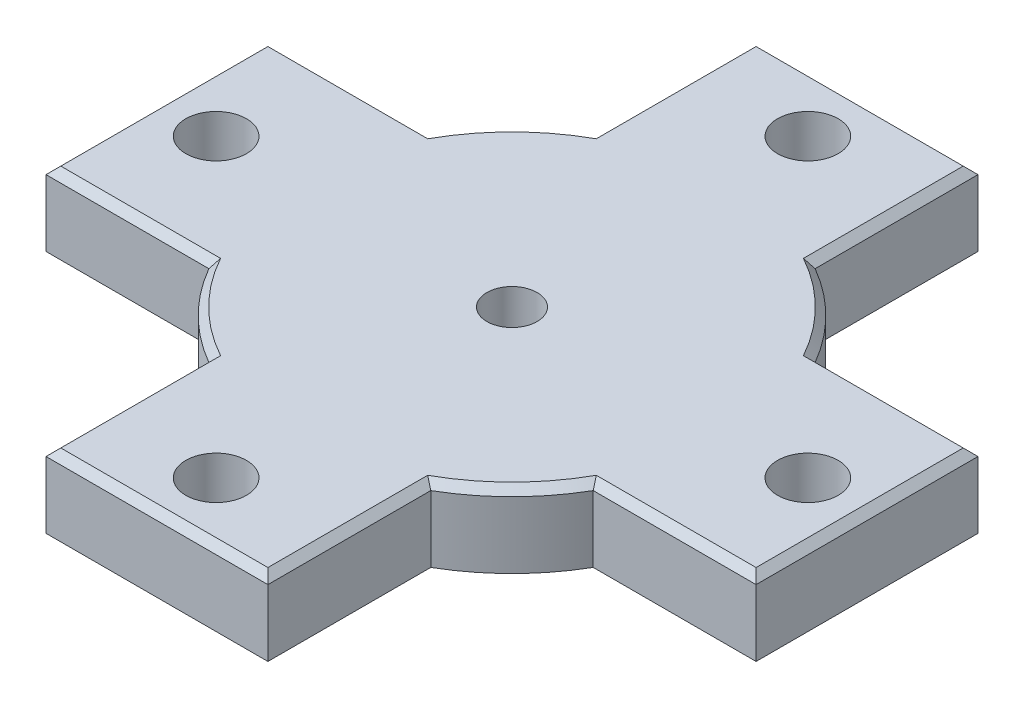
ISO-10303-21;
HEADER;
FILE_DESCRIPTION(('STEP AP214'),'2;1');
FILE_NAME('part.step','',(''),(''),'','','');
FILE_SCHEMA(('AUTOMOTIVE_DESIGN { 1 0 10303 214 1 1 1 1 }'));
ENDSEC;
DATA;
#1=APPLICATION_CONTEXT('core data for automotive mechanical design processes');
#2=APPLICATION_PROTOCOL_DEFINITION('international standard','automotive_design',2000,#1);
#3=PRODUCT_CONTEXT('',#1,'mechanical');
#4=PRODUCT('Part','Part','',(#3));
#5=PRODUCT_RELATED_PRODUCT_CATEGORY('part','',(#4));
#6=PRODUCT_DEFINITION_FORMATION('','',#4);
#7=PRODUCT_DEFINITION_CONTEXT('part definition',#1,'design');
#8=PRODUCT_DEFINITION('design','',#6,#7);
#9=PRODUCT_DEFINITION_SHAPE('','',#8);
#10=(LENGTH_UNIT() NAMED_UNIT(*) SI_UNIT(.MILLI.,.METRE.));
#11=(NAMED_UNIT(*) PLANE_ANGLE_UNIT() SI_UNIT($,.RADIAN.));
#12=(NAMED_UNIT(*) SI_UNIT($,.STERADIAN.) SOLID_ANGLE_UNIT());
#13=UNCERTAINTY_MEASURE_WITH_UNIT(LENGTH_MEASURE(1.E-05),#10,'distance_accuracy_value','');
#14=(GEOMETRIC_REPRESENTATION_CONTEXT(3) GLOBAL_UNCERTAINTY_ASSIGNED_CONTEXT((#13)) GLOBAL_UNIT_ASSIGNED_CONTEXT((#10,
#11,#12)) REPRESENTATION_CONTEXT('',''));
#15=CARTESIAN_POINT('',(0.,0.,0.));
#16=DIRECTION('',(0.,0.,1.));
#17=DIRECTION('',(1.,0.,0.));
#18=AXIS2_PLACEMENT_3D('',#15,#16,#17);
#19=CARTESIAN_POINT('',(0.,10.,0.));
#20=DIRECTION('',(0.,-1.,0.));
#21=DIRECTION('',(0.,0.,-1.));
#22=AXIS2_PLACEMENT_3D('',#19,#20,#21);
#23=CYLINDRICAL_SURFACE('',#22,30.);
#24=DIRECTION('',(0.,-1.,0.));
#25=VECTOR('',#24,1.);
#26=CARTESIAN_POINT('',(-25.9807621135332,10.,-15.));
#27=LINE('',#26,#25);
#28=CARTESIAN_POINT('',(-25.9807621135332,9.00000000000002,-15.));
#29=VERTEX_POINT('',#28);
#30=CARTESIAN_POINT('',(-25.9807621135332,0.,-15.));
#31=VERTEX_POINT('',#30);
#32=EDGE_CURVE('E207',#29,#31,#27,.T.);
#33=ORIENTED_EDGE('',*,*,#32,.F.);
#34=CARTESIAN_POINT('',(0.,9.00000000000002,0.));
#35=DIRECTION('',(0.,1.,0.));
#36=DIRECTION('',(0.,0.,1.));
#37=AXIS2_PLACEMENT_3D('',#34,#35,#36);
#38=CIRCLE('',#37,30.);
#39=CARTESIAN_POINT('',(-15.,9.00000000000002,-25.9807621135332));
#40=VERTEX_POINT('',#39);
#41=EDGE_CURVE('E12',#29,#40,#38,.F.);
#42=ORIENTED_EDGE('',*,*,#41,.T.);
#43=DIRECTION('',(0.,-1.,0.));
#44=VECTOR('',#43,1.);
#45=CARTESIAN_POINT('',(-15.,10.,-25.9807621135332));
#46=LINE('',#45,#44);
#47=CARTESIAN_POINT('',(-15.,0.,-25.9807621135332));
#48=VERTEX_POINT('',#47);
#49=EDGE_CURVE('E228',#40,#48,#46,.T.);
#50=ORIENTED_EDGE('',*,*,#49,.T.);
#51=CARTESIAN_POINT('',(0.,0.,0.));
#52=DIRECTION('',(0.,1.,0.));
#53=DIRECTION('',(0.,0.,1.));
#54=AXIS2_PLACEMENT_3D('',#51,#52,#53);
#55=CIRCLE('',#54,30.);
#56=EDGE_CURVE('E222',#48,#31,#55,.T.);
#57=ORIENTED_EDGE('',*,*,#56,.T.);
#58=EDGE_LOOP('',(#33,#42,#50,#57));
#59=FACE_BOUND('',#58,.T.);
#60=ADVANCED_FACE('F41',(#59),#23,.T.);
#61=CARTESIAN_POINT('',(-48.,10.,-15.));
#62=DIRECTION('',(0.,0.,1.));
#63=DIRECTION('',(1.,0.,0.));
#64=AXIS2_PLACEMENT_3D('',#61,#62,#63);
#65=PLANE('',#64);
#66=DIRECTION('',(0.,-1.,0.));
#67=VECTOR('',#66,1.);
#68=CARTESIAN_POINT('',(-48.,10.,-15.));
#69=LINE('',#68,#67);
#70=CARTESIAN_POINT('',(-48.,9.00000000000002,-15.));
#71=VERTEX_POINT('',#70);
#72=CARTESIAN_POINT('',(-48.,0.,-15.));
#73=VERTEX_POINT('',#72);
#74=EDGE_CURVE('E216',#71,#73,#69,.T.);
#75=ORIENTED_EDGE('',*,*,#74,.F.);
#76=DIRECTION('',(1.,0.,0.));
#77=VECTOR('',#76,1.);
#78=CARTESIAN_POINT('',(-25.9807621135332,9.00000000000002,-15.));
#79=LINE('',#78,#77);
#80=EDGE_CURVE('E56',#71,#29,#79,.T.);
#81=ORIENTED_EDGE('',*,*,#80,.T.);
#82=ORIENTED_EDGE('',*,*,#32,.T.);
#83=DIRECTION('',(-1.,0.,0.));
#84=VECTOR('',#83,1.);
#85=CARTESIAN_POINT('',(-48.,0.,-15.));
#86=LINE('',#85,#84);
#87=EDGE_CURVE('E210',#31,#73,#86,.T.);
#88=ORIENTED_EDGE('',*,*,#87,.T.);
#89=EDGE_LOOP('',(#75,#81,#82,#88));
#90=FACE_BOUND('',#89,.T.);
#91=ADVANCED_FACE('F209',(#90),#65,.F.);
#92=CARTESIAN_POINT('',(-48.,10.,15.));
#93=DIRECTION('',(1.,0.,0.));
#94=DIRECTION('',(0.,0.,-1.));
#95=AXIS2_PLACEMENT_3D('',#92,#93,#94);
#96=PLANE('',#95);
#97=DIRECTION('',(0.,-1.,0.));
#98=VECTOR('',#97,1.);
#99=CARTESIAN_POINT('',(-48.,10.,15.));
#100=LINE('',#99,#98);
#101=CARTESIAN_POINT('',(-48.,9.00000000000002,15.));
#102=VERTEX_POINT('',#101);
#103=CARTESIAN_POINT('',(-48.,0.,15.));
#104=VERTEX_POINT('',#103);
#105=EDGE_CURVE('E301',#102,#104,#100,.T.);
#106=ORIENTED_EDGE('',*,*,#105,.F.);
#107=DIRECTION('',(0.,0.,-1.));
#108=VECTOR('',#107,1.);
#109=CARTESIAN_POINT('',(-48.,9.00000000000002,-15.));
#110=LINE('',#109,#108);
#111=EDGE_CURVE('E71',#102,#71,#110,.T.);
#112=ORIENTED_EDGE('',*,*,#111,.T.);
#113=ORIENTED_EDGE('',*,*,#74,.T.);
#114=DIRECTION('',(0.,0.,1.));
#115=VECTOR('',#114,1.);
#116=CARTESIAN_POINT('',(-48.,0.,15.));
#117=LINE('',#116,#115);
#118=EDGE_CURVE('E225',#73,#104,#117,.T.);
#119=ORIENTED_EDGE('',*,*,#118,.T.);
#120=EDGE_LOOP('',(#106,#112,#113,#119));
#121=FACE_BOUND('',#120,.T.);
#122=ADVANCED_FACE('F549',(#121),#96,.F.);
#123=CARTESIAN_POINT('',(-25.9807621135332,10.,15.));
#124=DIRECTION('',(0.,0.,-1.));
#125=DIRECTION('',(-1.,0.,0.));
#126=AXIS2_PLACEMENT_3D('',#123,#124,#125);
#127=PLANE('',#126);
#128=DIRECTION('',(0.,-1.,0.));
#129=VECTOR('',#128,1.);
#130=CARTESIAN_POINT('',(-25.9807621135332,10.,15.));
#131=LINE('',#130,#129);
#132=CARTESIAN_POINT('',(-25.9807621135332,9.00000000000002,15.));
#133=VERTEX_POINT('',#132);
#134=CARTESIAN_POINT('',(-25.9807621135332,0.,15.));
#135=VERTEX_POINT('',#134);
#136=EDGE_CURVE('E299',#133,#135,#131,.T.);
#137=ORIENTED_EDGE('',*,*,#136,.F.);
#138=DIRECTION('',(-1.,0.,0.));
#139=VECTOR('',#138,1.);
#140=CARTESIAN_POINT('',(-48.,9.00000000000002,15.));
#141=LINE('',#140,#139);
#142=EDGE_CURVE('E361',#133,#102,#141,.T.);
#143=ORIENTED_EDGE('',*,*,#142,.T.);
#144=ORIENTED_EDGE('',*,*,#105,.T.);
#145=DIRECTION('',(1.,0.,0.));
#146=VECTOR('',#145,1.);
#147=CARTESIAN_POINT('',(-25.9807621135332,0.,15.));
#148=LINE('',#147,#146);
#149=EDGE_CURVE('E238',#104,#135,#148,.T.);
#150=ORIENTED_EDGE('',*,*,#149,.T.);
#151=EDGE_LOOP('',(#137,#143,#144,#150));
#152=FACE_BOUND('',#151,.T.);
#153=ADVANCED_FACE('F512',(#152),#127,.F.);
#154=CARTESIAN_POINT('',(0.,10.,0.));
#155=DIRECTION('',(0.,-1.,0.));
#156=DIRECTION('',(0.,0.,-1.));
#157=AXIS2_PLACEMENT_3D('',#154,#155,#156);
#158=CYLINDRICAL_SURFACE('',#157,30.);
#159=DIRECTION('',(0.,-1.,0.));
#160=VECTOR('',#159,1.);
#161=CARTESIAN_POINT('',(-15.,10.,25.9807621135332));
#162=LINE('',#161,#160);
#163=CARTESIAN_POINT('',(-15.,9.00000000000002,25.9807621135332));
#164=VERTEX_POINT('',#163);
#165=CARTESIAN_POINT('',(-15.,0.,25.9807621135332));
#166=VERTEX_POINT('',#165);
#167=EDGE_CURVE('E297',#164,#166,#162,.T.);
#168=ORIENTED_EDGE('',*,*,#167,.F.);
#169=CARTESIAN_POINT('',(0.,9.00000000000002,0.));
#170=DIRECTION('',(0.,1.,0.));
#171=DIRECTION('',(0.,0.,1.));
#172=AXIS2_PLACEMENT_3D('',#169,#170,#171);
#173=CIRCLE('',#172,30.);
#174=EDGE_CURVE('E359',#164,#133,#173,.F.);
#175=ORIENTED_EDGE('',*,*,#174,.T.);
#176=ORIENTED_EDGE('',*,*,#136,.T.);
#177=CARTESIAN_POINT('',(0.,0.,0.));
#178=DIRECTION('',(0.,1.,0.));
#179=DIRECTION('',(0.,0.,1.));
#180=AXIS2_PLACEMENT_3D('',#177,#178,#179);
#181=CIRCLE('',#180,30.);
#182=EDGE_CURVE('E241',#135,#166,#181,.T.);
#183=ORIENTED_EDGE('',*,*,#182,.T.);
#184=EDGE_LOOP('',(#168,#175,#176,#183));
#185=FACE_BOUND('',#184,.T.);
#186=ADVANCED_FACE('F510',(#185),#158,.T.);
#187=CARTESIAN_POINT('',(-15.,10.,48.));
#188=DIRECTION('',(1.,0.,0.));
#189=DIRECTION('',(0.,0.,-1.));
#190=AXIS2_PLACEMENT_3D('',#187,#188,#189);
#191=PLANE('',#190);
#192=DIRECTION('',(0.,-1.,0.));
#193=VECTOR('',#192,1.);
#194=CARTESIAN_POINT('',(-15.,10.,48.));
#195=LINE('',#194,#193);
#196=CARTESIAN_POINT('',(-15.,9.00000000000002,48.));
#197=VERTEX_POINT('',#196);
#198=CARTESIAN_POINT('',(-15.,0.,48.));
#199=VERTEX_POINT('',#198);
#200=EDGE_CURVE('E295',#197,#199,#195,.T.);
#201=ORIENTED_EDGE('',*,*,#200,.F.);
#202=DIRECTION('',(0.,0.,-1.));
#203=VECTOR('',#202,1.);
#204=CARTESIAN_POINT('',(-15.,9.00000000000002,25.9807621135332));
#205=LINE('',#204,#203);
#206=EDGE_CURVE('E357',#197,#164,#205,.T.);
#207=ORIENTED_EDGE('',*,*,#206,.T.);
#208=ORIENTED_EDGE('',*,*,#167,.T.);
#209=DIRECTION('',(0.,0.,1.));
#210=VECTOR('',#209,1.);
#211=CARTESIAN_POINT('',(-15.,0.,48.));
#212=LINE('',#211,#210);
#213=EDGE_CURVE('E244',#166,#199,#212,.T.);
#214=ORIENTED_EDGE('',*,*,#213,.T.);
#215=EDGE_LOOP('',(#201,#207,#208,#214));
#216=FACE_BOUND('',#215,.T.);
#217=ADVANCED_FACE('F519',(#216),#191,.F.);
#218=CARTESIAN_POINT('',(15.,10.,48.));
#219=DIRECTION('',(0.,0.,-1.));
#220=DIRECTION('',(-1.,0.,0.));
#221=AXIS2_PLACEMENT_3D('',#218,#219,#220);
#222=PLANE('',#221);
#223=DIRECTION('',(0.,-1.,0.));
#224=VECTOR('',#223,1.);
#225=CARTESIAN_POINT('',(15.,10.,48.));
#226=LINE('',#225,#224);
#227=CARTESIAN_POINT('',(15.,9.00000000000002,48.));
#228=VERTEX_POINT('',#227);
#229=CARTESIAN_POINT('',(15.,0.,48.));
#230=VERTEX_POINT('',#229);
#231=EDGE_CURVE('E293',#228,#230,#226,.T.);
#232=ORIENTED_EDGE('',*,*,#231,.F.);
#233=DIRECTION('',(-1.,0.,0.));
#234=VECTOR('',#233,1.);
#235=CARTESIAN_POINT('',(-15.,9.00000000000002,48.));
#236=LINE('',#235,#234);
#237=EDGE_CURVE('E355',#228,#197,#236,.T.);
#238=ORIENTED_EDGE('',*,*,#237,.T.);
#239=ORIENTED_EDGE('',*,*,#200,.T.);
#240=DIRECTION('',(1.,0.,0.));
#241=VECTOR('',#240,1.);
#242=CARTESIAN_POINT('',(15.,0.,48.));
#243=LINE('',#242,#241);
#244=EDGE_CURVE('E247',#199,#230,#243,.T.);
#245=ORIENTED_EDGE('',*,*,#244,.T.);
#246=EDGE_LOOP('',(#232,#238,#239,#245));
#247=FACE_BOUND('',#246,.T.);
#248=ADVANCED_FACE('F560',(#247),#222,.F.);
#249=CARTESIAN_POINT('',(15.,10.,25.9807621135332));
#250=DIRECTION('',(-1.,0.,0.));
#251=DIRECTION('',(0.,0.,1.));
#252=AXIS2_PLACEMENT_3D('',#249,#250,#251);
#253=PLANE('',#252);
#254=DIRECTION('',(0.,-1.,0.));
#255=VECTOR('',#254,1.);
#256=CARTESIAN_POINT('',(15.,10.,25.9807621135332));
#257=LINE('',#256,#255);
#258=CARTESIAN_POINT('',(15.,9.00000000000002,25.9807621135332));
#259=VERTEX_POINT('',#258);
#260=CARTESIAN_POINT('',(15.,0.,25.9807621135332));
#261=VERTEX_POINT('',#260);
#262=EDGE_CURVE('E291',#259,#261,#257,.T.);
#263=ORIENTED_EDGE('',*,*,#262,.F.);
#264=DIRECTION('',(0.,0.,1.));
#265=VECTOR('',#264,1.);
#266=CARTESIAN_POINT('',(15.,9.00000000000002,48.));
#267=LINE('',#266,#265);
#268=EDGE_CURVE('E353',#259,#228,#267,.T.);
#269=ORIENTED_EDGE('',*,*,#268,.T.);
#270=ORIENTED_EDGE('',*,*,#231,.T.);
#271=DIRECTION('',(0.,0.,-1.));
#272=VECTOR('',#271,1.);
#273=CARTESIAN_POINT('',(15.,0.,25.9807621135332));
#274=LINE('',#273,#272);
#275=EDGE_CURVE('E250',#230,#261,#274,.T.);
#276=ORIENTED_EDGE('',*,*,#275,.T.);
#277=EDGE_LOOP('',(#263,#269,#270,#276));
#278=FACE_BOUND('',#277,.T.);
#279=ADVANCED_FACE('F563',(#278),#253,.F.);
#280=CARTESIAN_POINT('',(0.,10.,0.));
#281=DIRECTION('',(0.,-1.,0.));
#282=DIRECTION('',(0.,0.,-1.));
#283=AXIS2_PLACEMENT_3D('',#280,#281,#282);
#284=CYLINDRICAL_SURFACE('',#283,30.);
#285=DIRECTION('',(0.,-1.,0.));
#286=VECTOR('',#285,1.);
#287=CARTESIAN_POINT('',(25.9807621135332,10.,15.));
#288=LINE('',#287,#286);
#289=CARTESIAN_POINT('',(25.9807621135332,9.00000000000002,15.));
#290=VERTEX_POINT('',#289);
#291=CARTESIAN_POINT('',(25.9807621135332,0.,15.));
#292=VERTEX_POINT('',#291);
#293=EDGE_CURVE('E289',#290,#292,#288,.T.);
#294=ORIENTED_EDGE('',*,*,#293,.F.);
#295=CARTESIAN_POINT('',(0.,9.00000000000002,0.));
#296=DIRECTION('',(0.,1.,0.));
#297=DIRECTION('',(0.,0.,1.));
#298=AXIS2_PLACEMENT_3D('',#295,#296,#297);
#299=CIRCLE('',#298,30.);
#300=EDGE_CURVE('E351',#290,#259,#299,.F.);
#301=ORIENTED_EDGE('',*,*,#300,.T.);
#302=ORIENTED_EDGE('',*,*,#262,.T.);
#303=CARTESIAN_POINT('',(0.,0.,0.));
#304=DIRECTION('',(0.,1.,0.));
#305=DIRECTION('',(0.,0.,1.));
#306=AXIS2_PLACEMENT_3D('',#303,#304,#305);
#307=CIRCLE('',#306,30.);
#308=EDGE_CURVE('E253',#261,#292,#307,.T.);
#309=ORIENTED_EDGE('',*,*,#308,.T.);
#310=EDGE_LOOP('',(#294,#301,#302,#309));
#311=FACE_BOUND('',#310,.T.);
#312=ADVANCED_FACE('F535',(#311),#284,.T.);
#313=CARTESIAN_POINT('',(48.,10.,15.));
#314=DIRECTION('',(0.,0.,-1.));
#315=DIRECTION('',(-1.,0.,0.));
#316=AXIS2_PLACEMENT_3D('',#313,#314,#315);
#317=PLANE('',#316);
#318=DIRECTION('',(0.,-1.,0.));
#319=VECTOR('',#318,1.);
#320=CARTESIAN_POINT('',(48.,10.,15.));
#321=LINE('',#320,#319);
#322=CARTESIAN_POINT('',(48.,9.00000000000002,15.));
#323=VERTEX_POINT('',#322);
#324=CARTESIAN_POINT('',(48.,0.,15.));
#325=VERTEX_POINT('',#324);
#326=EDGE_CURVE('E287',#323,#325,#321,.T.);
#327=ORIENTED_EDGE('',*,*,#326,.F.);
#328=DIRECTION('',(-1.,0.,0.));
#329=VECTOR('',#328,1.);
#330=CARTESIAN_POINT('',(25.9807621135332,9.00000000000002,15.));
#331=LINE('',#330,#329);
#332=EDGE_CURVE('E349',#323,#290,#331,.T.);
#333=ORIENTED_EDGE('',*,*,#332,.T.);
#334=ORIENTED_EDGE('',*,*,#293,.T.);
#335=DIRECTION('',(1.,0.,0.));
#336=VECTOR('',#335,1.);
#337=CARTESIAN_POINT('',(48.,0.,15.));
#338=LINE('',#337,#336);
#339=EDGE_CURVE('E256',#292,#325,#338,.T.);
#340=ORIENTED_EDGE('',*,*,#339,.T.);
#341=EDGE_LOOP('',(#327,#333,#334,#340));
#342=FACE_BOUND('',#341,.T.);
#343=ADVANCED_FACE('F532',(#342),#317,.F.);
#344=CARTESIAN_POINT('',(48.,10.,-15.));
#345=DIRECTION('',(-1.,0.,0.));
#346=DIRECTION('',(0.,0.,1.));
#347=AXIS2_PLACEMENT_3D('',#344,#345,#346);
#348=PLANE('',#347);
#349=DIRECTION('',(0.,-1.,0.));
#350=VECTOR('',#349,1.);
#351=CARTESIAN_POINT('',(48.,10.,-15.));
#352=LINE('',#351,#350);
#353=CARTESIAN_POINT('',(48.,9.00000000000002,-15.));
#354=VERTEX_POINT('',#353);
#355=CARTESIAN_POINT('',(48.,0.,-15.));
#356=VERTEX_POINT('',#355);
#357=EDGE_CURVE('E285',#354,#356,#352,.T.);
#358=ORIENTED_EDGE('',*,*,#357,.F.);
#359=DIRECTION('',(0.,0.,1.));
#360=VECTOR('',#359,1.);
#361=CARTESIAN_POINT('',(48.,9.00000000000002,15.));
#362=LINE('',#361,#360);
#363=EDGE_CURVE('E347',#354,#323,#362,.T.);
#364=ORIENTED_EDGE('',*,*,#363,.T.);
#365=ORIENTED_EDGE('',*,*,#326,.T.);
#366=DIRECTION('',(0.,0.,-1.));
#367=VECTOR('',#366,1.);
#368=CARTESIAN_POINT('',(48.,0.,-15.));
#369=LINE('',#368,#367);
#370=EDGE_CURVE('E259',#325,#356,#369,.T.);
#371=ORIENTED_EDGE('',*,*,#370,.T.);
#372=EDGE_LOOP('',(#358,#364,#365,#371));
#373=FACE_BOUND('',#372,.T.);
#374=ADVANCED_FACE('F571',(#373),#348,.F.);
#375=CARTESIAN_POINT('',(25.9807621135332,10.,-15.));
#376=DIRECTION('',(0.,0.,1.));
#377=DIRECTION('',(1.,0.,0.));
#378=AXIS2_PLACEMENT_3D('',#375,#376,#377);
#379=PLANE('',#378);
#380=DIRECTION('',(0.,-1.,0.));
#381=VECTOR('',#380,1.);
#382=CARTESIAN_POINT('',(25.9807621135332,10.,-15.));
#383=LINE('',#382,#381);
#384=CARTESIAN_POINT('',(25.9807621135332,9.00000000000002,-15.));
#385=VERTEX_POINT('',#384);
#386=CARTESIAN_POINT('',(25.9807621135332,0.,-15.));
#387=VERTEX_POINT('',#386);
#388=EDGE_CURVE('E283',#385,#387,#383,.T.);
#389=ORIENTED_EDGE('',*,*,#388,.F.);
#390=DIRECTION('',(1.,0.,0.));
#391=VECTOR('',#390,1.);
#392=CARTESIAN_POINT('',(48.,9.00000000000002,-15.));
#393=LINE('',#392,#391);
#394=EDGE_CURVE('E345',#385,#354,#393,.T.);
#395=ORIENTED_EDGE('',*,*,#394,.T.);
#396=ORIENTED_EDGE('',*,*,#357,.T.);
#397=DIRECTION('',(-1.,0.,0.));
#398=VECTOR('',#397,1.);
#399=CARTESIAN_POINT('',(25.9807621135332,0.,-15.));
#400=LINE('',#399,#398);
#401=EDGE_CURVE('E262',#356,#387,#400,.T.);
#402=ORIENTED_EDGE('',*,*,#401,.T.);
#403=EDGE_LOOP('',(#389,#395,#396,#402));
#404=FACE_BOUND('',#403,.T.);
#405=ADVANCED_FACE('F574',(#404),#379,.F.);
#406=CARTESIAN_POINT('',(0.,10.,0.));
#407=DIRECTION('',(0.,-1.,0.));
#408=DIRECTION('',(0.,0.,-1.));
#409=AXIS2_PLACEMENT_3D('',#406,#407,#408);
#410=CYLINDRICAL_SURFACE('',#409,30.);
#411=DIRECTION('',(0.,-1.,0.));
#412=VECTOR('',#411,1.);
#413=CARTESIAN_POINT('',(15.,10.,-25.9807621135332));
#414=LINE('',#413,#412);
#415=CARTESIAN_POINT('',(15.,9.00000000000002,-25.9807621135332));
#416=VERTEX_POINT('',#415);
#417=CARTESIAN_POINT('',(15.,0.,-25.9807621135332));
#418=VERTEX_POINT('',#417);
#419=EDGE_CURVE('E281',#416,#418,#414,.T.);
#420=ORIENTED_EDGE('',*,*,#419,.F.);
#421=CARTESIAN_POINT('',(0.,9.00000000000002,0.));
#422=DIRECTION('',(0.,1.,0.));
#423=DIRECTION('',(0.,0.,1.));
#424=AXIS2_PLACEMENT_3D('',#421,#422,#423);
#425=CIRCLE('',#424,30.);
#426=EDGE_CURVE('E343',#416,#385,#425,.F.);
#427=ORIENTED_EDGE('',*,*,#426,.T.);
#428=ORIENTED_EDGE('',*,*,#388,.T.);
#429=CARTESIAN_POINT('',(0.,0.,0.));
#430=DIRECTION('',(0.,1.,0.));
#431=DIRECTION('',(0.,0.,1.));
#432=AXIS2_PLACEMENT_3D('',#429,#430,#431);
#433=CIRCLE('',#432,30.);
#434=EDGE_CURVE('E265',#387,#418,#433,.T.);
#435=ORIENTED_EDGE('',*,*,#434,.T.);
#436=EDGE_LOOP('',(#420,#427,#428,#435));
#437=FACE_BOUND('',#436,.T.);
#438=ADVANCED_FACE('F578',(#437),#410,.T.);
#439=CARTESIAN_POINT('',(15.,10.,-48.));
#440=DIRECTION('',(-1.,0.,0.));
#441=DIRECTION('',(0.,0.,1.));
#442=AXIS2_PLACEMENT_3D('',#439,#440,#441);
#443=PLANE('',#442);
#444=DIRECTION('',(0.,-1.,0.));
#445=VECTOR('',#444,1.);
#446=CARTESIAN_POINT('',(15.,10.,-48.));
#447=LINE('',#446,#445);
#448=CARTESIAN_POINT('',(15.,9.00000000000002,-48.));
#449=VERTEX_POINT('',#448);
#450=CARTESIAN_POINT('',(15.,0.,-48.));
#451=VERTEX_POINT('',#450);
#452=EDGE_CURVE('E279',#449,#451,#447,.T.);
#453=ORIENTED_EDGE('',*,*,#452,.F.);
#454=DIRECTION('',(0.,0.,1.));
#455=VECTOR('',#454,1.);
#456=CARTESIAN_POINT('',(15.,9.00000000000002,-25.9807621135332));
#457=LINE('',#456,#455);
#458=EDGE_CURVE('E341',#449,#416,#457,.T.);
#459=ORIENTED_EDGE('',*,*,#458,.T.);
#460=ORIENTED_EDGE('',*,*,#419,.T.);
#461=DIRECTION('',(0.,0.,-1.));
#462=VECTOR('',#461,1.);
#463=CARTESIAN_POINT('',(15.,0.,-48.));
#464=LINE('',#463,#462);
#465=EDGE_CURVE('E268',#418,#451,#464,.T.);
#466=ORIENTED_EDGE('',*,*,#465,.T.);
#467=EDGE_LOOP('',(#453,#459,#460,#466));
#468=FACE_BOUND('',#467,.T.);
#469=ADVANCED_FACE('F582',(#468),#443,.F.);
#470=CARTESIAN_POINT('',(-15.,10.,-48.));
#471=DIRECTION('',(0.,0.,1.));
#472=DIRECTION('',(1.,0.,0.));
#473=AXIS2_PLACEMENT_3D('',#470,#471,#472);
#474=PLANE('',#473);
#475=DIRECTION('',(0.,-1.,0.));
#476=VECTOR('',#475,1.);
#477=CARTESIAN_POINT('',(-15.,10.,-48.));
#478=LINE('',#477,#476);
#479=CARTESIAN_POINT('',(-15.,9.00000000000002,-48.));
#480=VERTEX_POINT('',#479);
#481=CARTESIAN_POINT('',(-15.,0.,-48.));
#482=VERTEX_POINT('',#481);
#483=EDGE_CURVE('E277',#480,#482,#478,.T.);
#484=ORIENTED_EDGE('',*,*,#483,.F.);
#485=DIRECTION('',(1.,0.,0.));
#486=VECTOR('',#485,1.);
#487=CARTESIAN_POINT('',(15.,9.00000000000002,-48.));
#488=LINE('',#487,#486);
#489=EDGE_CURVE('E339',#480,#449,#488,.T.);
#490=ORIENTED_EDGE('',*,*,#489,.T.);
#491=ORIENTED_EDGE('',*,*,#452,.T.);
#492=DIRECTION('',(-1.,0.,0.));
#493=VECTOR('',#492,1.);
#494=CARTESIAN_POINT('',(-15.,0.,-48.));
#495=LINE('',#494,#493);
#496=EDGE_CURVE('E271',#451,#482,#495,.T.);
#497=ORIENTED_EDGE('',*,*,#496,.T.);
#498=EDGE_LOOP('',(#484,#490,#491,#497));
#499=FACE_BOUND('',#498,.T.);
#500=ADVANCED_FACE('F586',(#499),#474,.F.);
#501=CARTESIAN_POINT('',(-15.,10.,-25.9807621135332));
#502=DIRECTION('',(1.,0.,0.));
#503=DIRECTION('',(0.,0.,-1.));
#504=AXIS2_PLACEMENT_3D('',#501,#502,#503);
#505=PLANE('',#504);
#506=ORIENTED_EDGE('',*,*,#49,.F.);
#507=DIRECTION('',(0.,0.,-1.));
#508=VECTOR('',#507,1.);
#509=CARTESIAN_POINT('',(-15.,9.00000000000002,-48.));
#510=LINE('',#509,#508);
#511=EDGE_CURVE('E336',#40,#480,#510,.T.);
#512=ORIENTED_EDGE('',*,*,#511,.T.);
#513=ORIENTED_EDGE('',*,*,#483,.T.);
#514=DIRECTION('',(0.,0.,1.));
#515=VECTOR('',#514,1.);
#516=CARTESIAN_POINT('',(-15.,0.,-25.9807621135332));
#517=LINE('',#516,#515);
#518=EDGE_CURVE('E274',#482,#48,#517,.T.);
#519=ORIENTED_EDGE('',*,*,#518,.T.);
#520=EDGE_LOOP('',(#506,#512,#513,#519));
#521=FACE_BOUND('',#520,.T.);
#522=ADVANCED_FACE('F590',(#521),#505,.F.);
#523=CARTESIAN_POINT('',(0.,10.,0.));
#524=DIRECTION('',(0.,1.,0.));
#525=DIRECTION('',(0.,0.,1.));
#526=AXIS2_PLACEMENT_3D('',#523,#524,#525);
#527=PLANE('',#526);
#528=CARTESIAN_POINT('',(40.,10.,-1.39659253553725E-13));
#529=DIRECTION('',(0.,1.,0.));
#530=DIRECTION('',(1.,0.,0.));
#531=AXIS2_PLACEMENT_3D('',#528,#529,#530);
#532=CIRCLE('',#531,4.1);
#533=CARTESIAN_POINT('',(44.1,10.,-1.53974327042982E-13));
#534=VERTEX_POINT('',#533);
#535=EDGE_CURVE('E628',#534,#534,#532,.T.);
#536=ORIENTED_EDGE('',*,*,#535,.F.);
#537=EDGE_LOOP('',(#536));
#538=FACE_BOUND('',#537,.T.);
#539=CARTESIAN_POINT('',(0.,10.,-40.));
#540=DIRECTION('',(0.,1.,0.));
#541=DIRECTION('',(0.,0.,-1.));
#542=AXIS2_PLACEMENT_3D('',#539,#540,#541);
#543=CIRCLE('',#542,4.1);
#544=CARTESIAN_POINT('',(0.,10.,-44.1));
#545=VERTEX_POINT('',#544);
#546=EDGE_CURVE('E634',#545,#545,#543,.T.);
#547=ORIENTED_EDGE('',*,*,#546,.F.);
#548=EDGE_LOOP('',(#547));
#549=FACE_BOUND('',#548,.T.);
#550=CARTESIAN_POINT('',(-40.,10.,4.18977760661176E-13));
#551=DIRECTION('',(0.,1.,0.));
#552=DIRECTION('',(-1.,0.,0.));
#553=AXIS2_PLACEMENT_3D('',#550,#551,#552);
#554=CIRCLE('',#553,4.1);
#555=CARTESIAN_POINT('',(-44.1,10.,4.61922981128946E-13));
#556=VERTEX_POINT('',#555);
#557=EDGE_CURVE('E640',#556,#556,#554,.T.);
#558=ORIENTED_EDGE('',*,*,#557,.F.);
#559=EDGE_LOOP('',(#558));
#560=FACE_BOUND('',#559,.T.);
#561=CARTESIAN_POINT('',(0.,10.,40.));
#562=DIRECTION('',(0.,1.,0.));
#563=DIRECTION('',(0.,0.,1.));
#564=AXIS2_PLACEMENT_3D('',#561,#562,#563);
#565=CIRCLE('',#564,4.1);
#566=CARTESIAN_POINT('',(0.,10.,44.1));
#567=VERTEX_POINT('',#566);
#568=EDGE_CURVE('E629',#567,#567,#565,.T.);
#569=ORIENTED_EDGE('',*,*,#568,.F.);
#570=EDGE_LOOP('',(#569));
#571=FACE_BOUND('',#570,.T.);
#572=CARTESIAN_POINT('',(0.,10.,0.));
#573=DIRECTION('',(0.,1.,0.));
#574=DIRECTION('',(0.,0.,1.));
#575=AXIS2_PLACEMENT_3D('',#572,#573,#574);
#576=CIRCLE('',#575,3.4);
#577=CARTESIAN_POINT('',(0.,10.,3.4));
#578=VERTEX_POINT('',#577);
#579=EDGE_CURVE('E649',#578,#578,#576,.T.);
#580=ORIENTED_EDGE('',*,*,#579,.F.);
#581=EDGE_LOOP('',(#580));
#582=FACE_BOUND('',#581,.T.);
#583=DIRECTION('',(-1.,0.,0.));
#584=VECTOR('',#583,1.);
#585=CARTESIAN_POINT('',(-15.,10.,-47.));
#586=LINE('',#585,#584);
#587=CARTESIAN_POINT('',(14.,10.,-47.));
#588=VERTEX_POINT('',#587);
#589=CARTESIAN_POINT('',(-14.,10.,-47.));
#590=VERTEX_POINT('',#589);
#591=EDGE_CURVE('E331',#588,#590,#586,.T.);
#592=ORIENTED_EDGE('',*,*,#591,.T.);
#593=DIRECTION('',(0.,0.,1.));
#594=VECTOR('',#593,1.);
#595=CARTESIAN_POINT('',(-14.,10.,-25.9807621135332));
#596=LINE('',#595,#594);
#597=CARTESIAN_POINT('',(-14.,10.,-25.3968501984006));
#598=VERTEX_POINT('',#597);
#599=EDGE_CURVE('E333',#590,#598,#596,.T.);
#600=ORIENTED_EDGE('',*,*,#599,.T.);
#601=CARTESIAN_POINT('',(0.,10.,0.));
#602=DIRECTION('',(0.,1.,0.));
#603=DIRECTION('',(0.,0.,1.));
#604=AXIS2_PLACEMENT_3D('',#601,#602,#603);
#605=CIRCLE('',#604,29.);
#606=CARTESIAN_POINT('',(-25.3968501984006,10.,-14.));
#607=VERTEX_POINT('',#606);
#608=EDGE_CURVE('E215',#598,#607,#605,.T.);
#609=ORIENTED_EDGE('',*,*,#608,.T.);
#610=DIRECTION('',(-1.,0.,0.));
#611=VECTOR('',#610,1.);
#612=CARTESIAN_POINT('',(-48.,10.,-14.));
#613=LINE('',#612,#611);
#614=CARTESIAN_POINT('',(-47.,10.,-14.));
#615=VERTEX_POINT('',#614);
#616=EDGE_CURVE('E305',#607,#615,#613,.T.);
#617=ORIENTED_EDGE('',*,*,#616,.T.);
#618=DIRECTION('',(0.,0.,1.));
#619=VECTOR('',#618,1.);
#620=CARTESIAN_POINT('',(-47.,10.,15.));
#621=LINE('',#620,#619);
#622=CARTESIAN_POINT('',(-47.,10.,14.));
#623=VERTEX_POINT('',#622);
#624=EDGE_CURVE('E307',#615,#623,#621,.T.);
#625=ORIENTED_EDGE('',*,*,#624,.T.);
#626=DIRECTION('',(1.,0.,0.));
#627=VECTOR('',#626,1.);
#628=CARTESIAN_POINT('',(-25.9807621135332,10.,14.));
#629=LINE('',#628,#627);
#630=CARTESIAN_POINT('',(-25.3968501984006,10.,14.));
#631=VERTEX_POINT('',#630);
#632=EDGE_CURVE('E309',#623,#631,#629,.T.);
#633=ORIENTED_EDGE('',*,*,#632,.T.);
#634=CARTESIAN_POINT('',(0.,10.,0.));
#635=DIRECTION('',(0.,1.,0.));
#636=DIRECTION('',(0.,0.,1.));
#637=AXIS2_PLACEMENT_3D('',#634,#635,#636);
#638=CIRCLE('',#637,29.);
#639=CARTESIAN_POINT('',(-14.,10.,25.3968501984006));
#640=VERTEX_POINT('',#639);
#641=EDGE_CURVE('E311',#631,#640,#638,.T.);
#642=ORIENTED_EDGE('',*,*,#641,.T.);
#643=DIRECTION('',(0.,0.,1.));
#644=VECTOR('',#643,1.);
#645=CARTESIAN_POINT('',(-14.,10.,48.));
#646=LINE('',#645,#644);
#647=CARTESIAN_POINT('',(-14.,10.,47.));
#648=VERTEX_POINT('',#647);
#649=EDGE_CURVE('E313',#640,#648,#646,.T.);
#650=ORIENTED_EDGE('',*,*,#649,.T.);
#651=DIRECTION('',(1.,0.,0.));
#652=VECTOR('',#651,1.);
#653=CARTESIAN_POINT('',(15.,10.,47.));
#654=LINE('',#653,#652);
#655=CARTESIAN_POINT('',(14.,10.,47.));
#656=VERTEX_POINT('',#655);
#657=EDGE_CURVE('E315',#648,#656,#654,.T.);
#658=ORIENTED_EDGE('',*,*,#657,.T.);
#659=DIRECTION('',(0.,0.,-1.));
#660=VECTOR('',#659,1.);
#661=CARTESIAN_POINT('',(14.,10.,25.9807621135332));
#662=LINE('',#661,#660);
#663=CARTESIAN_POINT('',(14.,10.,25.3968501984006));
#664=VERTEX_POINT('',#663);
#665=EDGE_CURVE('E317',#656,#664,#662,.T.);
#666=ORIENTED_EDGE('',*,*,#665,.T.);
#667=CARTESIAN_POINT('',(0.,10.,0.));
#668=DIRECTION('',(0.,1.,0.));
#669=DIRECTION('',(0.,0.,1.));
#670=AXIS2_PLACEMENT_3D('',#667,#668,#669);
#671=CIRCLE('',#670,29.);
#672=CARTESIAN_POINT('',(25.3968501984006,10.,14.));
#673=VERTEX_POINT('',#672);
#674=EDGE_CURVE('E319',#664,#673,#671,.T.);
#675=ORIENTED_EDGE('',*,*,#674,.T.);
#676=DIRECTION('',(1.,0.,0.));
#677=VECTOR('',#676,1.);
#678=CARTESIAN_POINT('',(48.,10.,14.));
#679=LINE('',#678,#677);
#680=CARTESIAN_POINT('',(47.,10.,14.));
#681=VERTEX_POINT('',#680);
#682=EDGE_CURVE('E321',#673,#681,#679,.T.);
#683=ORIENTED_EDGE('',*,*,#682,.T.);
#684=DIRECTION('',(0.,0.,-1.));
#685=VECTOR('',#684,1.);
#686=CARTESIAN_POINT('',(47.,10.,-15.));
#687=LINE('',#686,#685);
#688=CARTESIAN_POINT('',(47.,10.,-14.));
#689=VERTEX_POINT('',#688);
#690=EDGE_CURVE('E323',#681,#689,#687,.T.);
#691=ORIENTED_EDGE('',*,*,#690,.T.);
#692=DIRECTION('',(-1.,0.,0.));
#693=VECTOR('',#692,1.);
#694=CARTESIAN_POINT('',(25.9807621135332,10.,-14.));
#695=LINE('',#694,#693);
#696=CARTESIAN_POINT('',(25.3968501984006,10.,-14.));
#697=VERTEX_POINT('',#696);
#698=EDGE_CURVE('E325',#689,#697,#695,.T.);
#699=ORIENTED_EDGE('',*,*,#698,.T.);
#700=CARTESIAN_POINT('',(0.,10.,0.));
#701=DIRECTION('',(0.,1.,0.));
#702=DIRECTION('',(0.,0.,1.));
#703=AXIS2_PLACEMENT_3D('',#700,#701,#702);
#704=CIRCLE('',#703,29.);
#705=CARTESIAN_POINT('',(14.,10.,-25.3968501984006));
#706=VERTEX_POINT('',#705);
#707=EDGE_CURVE('E327',#697,#706,#704,.T.);
#708=ORIENTED_EDGE('',*,*,#707,.T.);
#709=DIRECTION('',(0.,0.,-1.));
#710=VECTOR('',#709,1.);
#711=CARTESIAN_POINT('',(14.,10.,-48.));
#712=LINE('',#711,#710);
#713=EDGE_CURVE('E329',#706,#588,#712,.T.);
#714=ORIENTED_EDGE('',*,*,#713,.T.);
#715=EDGE_LOOP('',(#592,#600,#609,#617,#625,#633,#642,#650,#658,#666,#675,#683,#691,#699,#708,#714));
#716=FACE_BOUND('',#715,.T.);
#717=ADVANCED_FACE('F497',(#538,#549,#560,#571,#582,#716),#527,.T.);
#718=CARTESIAN_POINT('',(0.,0.,0.));
#719=DIRECTION('',(0.,1.,0.));
#720=DIRECTION('',(0.,0.,1.));
#721=AXIS2_PLACEMENT_3D('',#718,#719,#720);
#722=PLANE('',#721);
#723=CARTESIAN_POINT('',(40.,0.,-1.39659253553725E-13));
#724=DIRECTION('',(0.,1.,0.));
#725=DIRECTION('',(1.,0.,0.));
#726=AXIS2_PLACEMENT_3D('',#723,#724,#725);
#727=CIRCLE('',#726,4.1);
#728=CARTESIAN_POINT('',(44.1,0.,-1.53974327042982E-13));
#729=VERTEX_POINT('',#728);
#730=EDGE_CURVE('E625',#729,#729,#727,.T.);
#731=ORIENTED_EDGE('',*,*,#730,.T.);
#732=EDGE_LOOP('',(#731));
#733=FACE_BOUND('',#732,.T.);
#734=CARTESIAN_POINT('',(0.,0.,-40.));
#735=DIRECTION('',(0.,1.,0.));
#736=DIRECTION('',(0.,0.,-1.));
#737=AXIS2_PLACEMENT_3D('',#734,#735,#736);
#738=CIRCLE('',#737,4.1);
#739=CARTESIAN_POINT('',(0.,0.,-44.1));
#740=VERTEX_POINT('',#739);
#741=EDGE_CURVE('E637',#740,#740,#738,.T.);
#742=ORIENTED_EDGE('',*,*,#741,.T.);
#743=EDGE_LOOP('',(#742));
#744=FACE_BOUND('',#743,.T.);
#745=CARTESIAN_POINT('',(-40.,0.,4.18977760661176E-13));
#746=DIRECTION('',(0.,1.,0.));
#747=DIRECTION('',(-1.,0.,0.));
#748=AXIS2_PLACEMENT_3D('',#745,#746,#747);
#749=CIRCLE('',#748,4.1);
#750=CARTESIAN_POINT('',(-44.1,0.,4.61922981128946E-13));
#751=VERTEX_POINT('',#750);
#752=EDGE_CURVE('E643',#751,#751,#749,.T.);
#753=ORIENTED_EDGE('',*,*,#752,.T.);
#754=EDGE_LOOP('',(#753));
#755=FACE_BOUND('',#754,.T.);
#756=CARTESIAN_POINT('',(0.,0.,40.));
#757=DIRECTION('',(0.,1.,0.));
#758=DIRECTION('',(0.,0.,1.));
#759=AXIS2_PLACEMENT_3D('',#756,#757,#758);
#760=CIRCLE('',#759,4.1);
#761=CARTESIAN_POINT('',(0.,0.,44.1));
#762=VERTEX_POINT('',#761);
#763=EDGE_CURVE('E632',#762,#762,#760,.T.);
#764=ORIENTED_EDGE('',*,*,#763,.T.);
#765=EDGE_LOOP('',(#764));
#766=FACE_BOUND('',#765,.T.);
#767=CARTESIAN_POINT('',(0.,0.,0.));
#768=DIRECTION('',(0.,1.,0.));
#769=DIRECTION('',(0.,0.,1.));
#770=AXIS2_PLACEMENT_3D('',#767,#768,#769);
#771=CIRCLE('',#770,3.39999999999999);
#772=CARTESIAN_POINT('',(0.,0.,3.39999999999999));
#773=VERTEX_POINT('',#772);
#774=EDGE_CURVE('E234',#773,#773,#771,.T.);
#775=ORIENTED_EDGE('',*,*,#774,.T.);
#776=EDGE_LOOP('',(#775));
#777=FACE_BOUND('',#776,.T.);
#778=ORIENTED_EDGE('',*,*,#56,.F.);
#779=ORIENTED_EDGE('',*,*,#518,.F.);
#780=ORIENTED_EDGE('',*,*,#496,.F.);
#781=ORIENTED_EDGE('',*,*,#465,.F.);
#782=ORIENTED_EDGE('',*,*,#434,.F.);
#783=ORIENTED_EDGE('',*,*,#401,.F.);
#784=ORIENTED_EDGE('',*,*,#370,.F.);
#785=ORIENTED_EDGE('',*,*,#339,.F.);
#786=ORIENTED_EDGE('',*,*,#308,.F.);
#787=ORIENTED_EDGE('',*,*,#275,.F.);
#788=ORIENTED_EDGE('',*,*,#244,.F.);
#789=ORIENTED_EDGE('',*,*,#213,.F.);
#790=ORIENTED_EDGE('',*,*,#182,.F.);
#791=ORIENTED_EDGE('',*,*,#149,.F.);
#792=ORIENTED_EDGE('',*,*,#118,.F.);
#793=ORIENTED_EDGE('',*,*,#87,.F.);
#794=EDGE_LOOP('',(#778,#779,#780,#781,#782,#783,#784,#785,#786,#787,#788,#789,#790,#791,#792,#793));
#795=FACE_BOUND('',#794,.T.);
#796=ADVANCED_FACE('F220',(#733,#744,#755,#766,#777,#795),#722,.F.);
#797=CARTESIAN_POINT('',(14.,10.,0.));
#798=DIRECTION('',(0.707106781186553,0.707106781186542,0.));
#799=DIRECTION('',(0.,0.,1.));
#800=AXIS2_PLACEMENT_3D('',#797,#798,#799);
#801=PLANE('',#800);
#802=DIRECTION('',(-0.577350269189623,0.577350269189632,-0.577350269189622));
#803=VECTOR('',#802,1.);
#804=CARTESIAN_POINT('',(9.3333333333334,14.6666666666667,42.3333333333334));
#805=LINE('',#804,#803);
#806=EDGE_CURVE('E232',#228,#656,#805,.T.);
#807=ORIENTED_EDGE('',*,*,#806,.F.);
#808=ORIENTED_EDGE('',*,*,#268,.F.);
#809=CARTESIAN_POINT('',(15.,9.00000000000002,25.9807621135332));
#810=CARTESIAN_POINT('',(14.8330574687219,9.16694253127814,25.8843883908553));
#811=CARTESIAN_POINT('',(14.6662528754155,9.33374712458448,25.7875422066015));
#812=CARTESIAN_POINT('',(14.3329195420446,9.66708045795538,25.5929049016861));
#813=CARTESIAN_POINT('',(14.1663908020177,9.83360919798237,25.4951137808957));
#814=CARTESIAN_POINT('',(14.,10.,25.3968501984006));
#815=B_SPLINE_CURVE_WITH_KNOTS('',3,(#809,#810,#811,#812,#813,#814),.UNSPECIFIED.,.F.,.F.,(4,2,
4),(0.,0.765010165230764,1.53002043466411),.UNSPECIFIED.);
#816=EDGE_CURVE('E46',#664,#259,#815,.F.);
#817=ORIENTED_EDGE('',*,*,#816,.F.);
#818=ORIENTED_EDGE('',*,*,#665,.F.);
#819=EDGE_LOOP('',(#807,#808,#817,#818));
#820=FACE_BOUND('',#819,.T.);
#821=ADVANCED_FACE('F43',(#820),#801,.T.);
#822=CARTESIAN_POINT('',(0.,10.,0.));
#823=DIRECTION('',(0.,-1.,0.));
#824=DIRECTION('',(0.,0.,-1.));
#825=AXIS2_PLACEMENT_3D('',#822,#823,#824);
#826=CONICAL_SURFACE('',#825,29.,0.78539816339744);
#827=ORIENTED_EDGE('',*,*,#816,.T.);
#828=ORIENTED_EDGE('',*,*,#300,.F.);
#829=CARTESIAN_POINT('',(25.9807621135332,9.00000000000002,15.));
#830=CARTESIAN_POINT('',(25.8843883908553,9.16694253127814,14.8330574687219));
#831=CARTESIAN_POINT('',(25.7875422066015,9.33374712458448,14.6662528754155));
#832=CARTESIAN_POINT('',(25.5929049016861,9.66708045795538,14.3329195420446));
#833=CARTESIAN_POINT('',(25.4951137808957,9.83360919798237,14.1663908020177));
#834=CARTESIAN_POINT('',(25.3968501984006,10.,14.));
#835=B_SPLINE_CURVE_WITH_KNOTS('',3,(#829,#830,#831,#832,#833,#834),.UNSPECIFIED.,.F.,.F.,(4,2,
4),(0.,0.765010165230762,1.53002043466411),.UNSPECIFIED.);
#836=EDGE_CURVE('E477',#673,#290,#835,.F.);
#837=ORIENTED_EDGE('',*,*,#836,.F.);
#838=ORIENTED_EDGE('',*,*,#674,.F.);
#839=EDGE_LOOP('',(#827,#828,#837,#838));
#840=FACE_BOUND('',#839,.T.);
#841=ADVANCED_FACE('F474',(#840),#826,.T.);
#842=CARTESIAN_POINT('',(0.,10.,47.));
#843=DIRECTION('',(0.,0.707106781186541,0.707106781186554));
#844=DIRECTION('',(-1.,0.,0.));
#845=AXIS2_PLACEMENT_3D('',#842,#843,#844);
#846=PLANE('',#845);
#847=ORIENTED_EDGE('',*,*,#806,.T.);
#848=ORIENTED_EDGE('',*,*,#657,.F.);
#849=DIRECTION('',(0.577350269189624,0.577350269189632,-0.577350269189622));
#850=VECTOR('',#849,1.);
#851=CARTESIAN_POINT('',(1.66666666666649,25.6666666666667,31.3333333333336));
#852=LINE('',#851,#850);
#853=EDGE_CURVE('E483',#197,#648,#852,.T.);
#854=ORIENTED_EDGE('',*,*,#853,.F.);
#855=ORIENTED_EDGE('',*,*,#237,.F.);
#856=EDGE_LOOP('',(#847,#848,#854,#855));
#857=FACE_BOUND('',#856,.T.);
#858=ADVANCED_FACE('F472',(#857),#846,.T.);
#859=CARTESIAN_POINT('',(0.,10.,14.));
#860=DIRECTION('',(0.,0.707106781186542,0.707106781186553));
#861=DIRECTION('',(-1.,0.,0.));
#862=AXIS2_PLACEMENT_3D('',#859,#860,#861);
#863=PLANE('',#862);
#864=ORIENTED_EDGE('',*,*,#836,.T.);
#865=ORIENTED_EDGE('',*,*,#332,.F.);
#866=DIRECTION('',(-0.577350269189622,0.577350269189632,-0.577350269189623));
#867=VECTOR('',#866,1.);
#868=CARTESIAN_POINT('',(31.3333333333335,25.6666666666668,-1.66666666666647));
#869=LINE('',#868,#867);
#870=EDGE_CURVE('E458',#681,#323,#869,.F.);
#871=ORIENTED_EDGE('',*,*,#870,.F.);
#872=ORIENTED_EDGE('',*,*,#682,.F.);
#873=EDGE_LOOP('',(#864,#865,#871,#872));
#874=FACE_BOUND('',#873,.T.);
#875=ADVANCED_FACE('F465',(#874),#863,.T.);
#876=CARTESIAN_POINT('',(-14.,10.,0.));
#877=DIRECTION('',(-0.707106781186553,0.707106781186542,0.));
#878=DIRECTION('',(0.,0.,-1.));
#879=AXIS2_PLACEMENT_3D('',#876,#877,#878);
#880=PLANE('',#879);
#881=ORIENTED_EDGE('',*,*,#853,.T.);
#882=ORIENTED_EDGE('',*,*,#649,.F.);
#883=CARTESIAN_POINT('',(-15.,9.00000000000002,25.9807621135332));
#884=CARTESIAN_POINT('',(-14.8330574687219,9.16694253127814,25.8843883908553));
#885=CARTESIAN_POINT('',(-14.6662528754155,9.33374712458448,25.7875422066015));
#886=CARTESIAN_POINT('',(-14.3329195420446,9.66708045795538,25.5929049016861));
#887=CARTESIAN_POINT('',(-14.1663908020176,9.83360919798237,25.4951137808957));
#888=CARTESIAN_POINT('',(-14.,10.,25.3968501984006));
#889=B_SPLINE_CURVE_WITH_KNOTS('',3,(#883,#884,#885,#886,#887,#888),.UNSPECIFIED.,.F.,.F.,(4,2,
4),(0.,0.765010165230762,1.53002043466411),.UNSPECIFIED.);
#890=EDGE_CURVE('E451',#164,#640,#889,.T.);
#891=ORIENTED_EDGE('',*,*,#890,.F.);
#892=ORIENTED_EDGE('',*,*,#206,.F.);
#893=EDGE_LOOP('',(#881,#882,#891,#892));
#894=FACE_BOUND('',#893,.T.);
#895=ADVANCED_FACE('F461',(#894),#880,.T.);
#896=CARTESIAN_POINT('',(47.,10.,0.));
#897=DIRECTION('',(0.707106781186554,0.707106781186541,0.));
#898=DIRECTION('',(0.,0.,1.));
#899=AXIS2_PLACEMENT_3D('',#896,#897,#898);
#900=PLANE('',#899);
#901=ORIENTED_EDGE('',*,*,#870,.T.);
#902=ORIENTED_EDGE('',*,*,#363,.F.);
#903=DIRECTION('',(-0.577350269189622,0.577350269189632,0.577350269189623));
#904=VECTOR('',#903,1.);
#905=CARTESIAN_POINT('',(42.3333333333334,14.6666666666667,-9.3333333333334));
#906=LINE('',#905,#904);
#907=EDGE_CURVE('E459',#689,#354,#906,.F.);
#908=ORIENTED_EDGE('',*,*,#907,.F.);
#909=ORIENTED_EDGE('',*,*,#690,.F.);
#910=EDGE_LOOP('',(#901,#902,#908,#909));
#911=FACE_BOUND('',#910,.T.);
#912=ADVANCED_FACE('F445',(#911),#900,.T.);
#913=CARTESIAN_POINT('',(0.,10.,0.));
#914=DIRECTION('',(0.,-1.,0.));
#915=DIRECTION('',(0.,0.,-1.));
#916=AXIS2_PLACEMENT_3D('',#913,#914,#915);
#917=CONICAL_SURFACE('',#916,29.,0.78539816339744);
#918=ORIENTED_EDGE('',*,*,#890,.T.);
#919=ORIENTED_EDGE('',*,*,#641,.F.);
#920=CARTESIAN_POINT('',(-25.9807621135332,9.00000000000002,15.));
#921=CARTESIAN_POINT('',(-25.8843883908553,9.16694253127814,14.8330574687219));
#922=CARTESIAN_POINT('',(-25.7875422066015,9.33374712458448,14.6662528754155));
#923=CARTESIAN_POINT('',(-25.5929049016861,9.66708045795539,14.3329195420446));
#924=CARTESIAN_POINT('',(-25.4951137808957,9.83360919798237,14.1663908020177));
#925=CARTESIAN_POINT('',(-25.3968501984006,10.,14.));
#926=B_SPLINE_CURVE_WITH_KNOTS('',3,(#920,#921,#922,#923,#924,#925),.UNSPECIFIED.,.F.,.F.,(4,2,
4),(0.,0.765010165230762,1.53002043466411),.UNSPECIFIED.);
#927=EDGE_CURVE('E430',#133,#631,#926,.T.);
#928=ORIENTED_EDGE('',*,*,#927,.F.);
#929=ORIENTED_EDGE('',*,*,#174,.F.);
#930=EDGE_LOOP('',(#918,#919,#928,#929));
#931=FACE_BOUND('',#930,.T.);
#932=ADVANCED_FACE('F441',(#931),#917,.T.);
#933=CARTESIAN_POINT('',(0.,10.,-14.));
#934=DIRECTION('',(0.,0.707106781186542,-0.707106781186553));
#935=DIRECTION('',(1.,0.,0.));
#936=AXIS2_PLACEMENT_3D('',#933,#934,#935);
#937=PLANE('',#936);
#938=ORIENTED_EDGE('',*,*,#907,.T.);
#939=ORIENTED_EDGE('',*,*,#394,.F.);
#940=CARTESIAN_POINT('',(25.9807621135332,9.00000000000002,-15.));
#941=CARTESIAN_POINT('',(25.8843883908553,9.16694253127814,-14.8330574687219));
#942=CARTESIAN_POINT('',(25.7875422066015,9.33374712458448,-14.6662528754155));
#943=CARTESIAN_POINT('',(25.5929049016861,9.66708045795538,-14.3329195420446));
#944=CARTESIAN_POINT('',(25.4951137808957,9.83360919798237,-14.1663908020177));
#945=CARTESIAN_POINT('',(25.3968501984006,10.,-14.));
#946=B_SPLINE_CURVE_WITH_KNOTS('',3,(#940,#941,#942,#943,#944,#945),.UNSPECIFIED.,.F.,.F.,(4,2,
4),(0.,0.765010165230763,1.53002043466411),.UNSPECIFIED.);
#947=EDGE_CURVE('E423',#697,#385,#946,.F.);
#948=ORIENTED_EDGE('',*,*,#947,.F.);
#949=ORIENTED_EDGE('',*,*,#698,.F.);
#950=EDGE_LOOP('',(#938,#939,#948,#949));
#951=FACE_BOUND('',#950,.T.);
#952=ADVANCED_FACE('F438',(#951),#937,.T.);
#953=CARTESIAN_POINT('',(0.,10.,14.));
#954=DIRECTION('',(0.,0.707106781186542,0.707106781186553));
#955=DIRECTION('',(-1.,0.,0.));
#956=AXIS2_PLACEMENT_3D('',#953,#954,#955);
#957=PLANE('',#956);
#958=ORIENTED_EDGE('',*,*,#927,.T.);
#959=ORIENTED_EDGE('',*,*,#632,.F.);
#960=DIRECTION('',(0.577350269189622,0.577350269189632,-0.577350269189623));
#961=VECTOR('',#960,1.);
#962=CARTESIAN_POINT('',(-42.3333333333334,14.6666666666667,9.3333333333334));
#963=LINE('',#962,#961);
#964=EDGE_CURVE('E410',#102,#623,#963,.T.);
#965=ORIENTED_EDGE('',*,*,#964,.F.);
#966=ORIENTED_EDGE('',*,*,#142,.F.);
#967=EDGE_LOOP('',(#958,#959,#965,#966));
#968=FACE_BOUND('',#967,.T.);
#969=ADVANCED_FACE('F419',(#968),#957,.T.);
#970=CARTESIAN_POINT('',(0.,10.,0.));
#971=DIRECTION('',(0.,-1.,0.));
#972=DIRECTION('',(0.,0.,-1.));
#973=AXIS2_PLACEMENT_3D('',#970,#971,#972);
#974=CONICAL_SURFACE('',#973,29.,0.78539816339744);
#975=ORIENTED_EDGE('',*,*,#947,.T.);
#976=ORIENTED_EDGE('',*,*,#426,.F.);
#977=CARTESIAN_POINT('',(15.,9.00000000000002,-25.9807621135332));
#978=CARTESIAN_POINT('',(14.8330574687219,9.16694253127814,-25.8843883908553));
#979=CARTESIAN_POINT('',(14.6662528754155,9.33374712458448,-25.7875422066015));
#980=CARTESIAN_POINT('',(14.3329195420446,9.66708045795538,-25.5929049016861));
#981=CARTESIAN_POINT('',(14.1663908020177,9.83360919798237,-25.4951137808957));
#982=CARTESIAN_POINT('',(14.,10.,-25.3968501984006));
#983=B_SPLINE_CURVE_WITH_KNOTS('',3,(#977,#978,#979,#980,#981,#982),.UNSPECIFIED.,.F.,.F.,(4,2,
4),(0.,0.765010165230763,1.53002043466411),.UNSPECIFIED.);
#984=EDGE_CURVE('E401',#706,#416,#983,.F.);
#985=ORIENTED_EDGE('',*,*,#984,.F.);
#986=ORIENTED_EDGE('',*,*,#707,.F.);
#987=EDGE_LOOP('',(#975,#976,#985,#986));
#988=FACE_BOUND('',#987,.T.);
#989=ADVANCED_FACE('F414',(#988),#974,.T.);
#990=CARTESIAN_POINT('',(-47.,10.,0.));
#991=DIRECTION('',(-0.707106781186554,0.707106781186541,0.));
#992=DIRECTION('',(0.,0.,-1.));
#993=AXIS2_PLACEMENT_3D('',#990,#991,#992);
#994=PLANE('',#993);
#995=ORIENTED_EDGE('',*,*,#964,.T.);
#996=ORIENTED_EDGE('',*,*,#624,.F.);
#997=DIRECTION('',(0.577350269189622,0.577350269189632,0.577350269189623));
#998=VECTOR('',#997,1.);
#999=CARTESIAN_POINT('',(-31.3333333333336,25.6666666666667,1.66666666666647));
#1000=LINE('',#999,#998);
#1001=EDGE_CURVE('E398',#71,#615,#1000,.T.);
#1002=ORIENTED_EDGE('',*,*,#1001,.F.);
#1003=ORIENTED_EDGE('',*,*,#111,.F.);
#1004=EDGE_LOOP('',(#995,#996,#1002,#1003));
#1005=FACE_BOUND('',#1004,.T.);
#1006=ADVANCED_FACE('F418',(#1005),#994,.T.);
#1007=CARTESIAN_POINT('',(14.,10.,0.));
#1008=DIRECTION('',(0.707106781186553,0.707106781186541,0.));
#1009=DIRECTION('',(0.,0.,1.));
#1010=AXIS2_PLACEMENT_3D('',#1007,#1008,#1009);
#1011=PLANE('',#1010);
#1012=ORIENTED_EDGE('',*,*,#984,.T.);
#1013=ORIENTED_EDGE('',*,*,#458,.F.);
#1014=DIRECTION('',(-0.577350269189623,0.577350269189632,0.577350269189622));
#1015=VECTOR('',#1014,1.);
#1016=CARTESIAN_POINT('',(-1.66666666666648,25.6666666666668,-31.3333333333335));
#1017=LINE('',#1016,#1015);
#1018=EDGE_CURVE('E395',#588,#449,#1017,.F.);
#1019=ORIENTED_EDGE('',*,*,#1018,.F.);
#1020=ORIENTED_EDGE('',*,*,#713,.F.);
#1021=EDGE_LOOP('',(#1012,#1013,#1019,#1020));
#1022=FACE_BOUND('',#1021,.T.);
#1023=ADVANCED_FACE('F412',(#1022),#1011,.T.);
#1024=CARTESIAN_POINT('',(0.,10.,-14.));
#1025=DIRECTION('',(0.,0.707106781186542,-0.707106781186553));
#1026=DIRECTION('',(1.,0.,0.));
#1027=AXIS2_PLACEMENT_3D('',#1024,#1025,#1026);
#1028=PLANE('',#1027);
#1029=ORIENTED_EDGE('',*,*,#1001,.T.);
#1030=ORIENTED_EDGE('',*,*,#616,.F.);
#1031=CARTESIAN_POINT('',(-25.9807621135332,9.00000000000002,-15.));
#1032=CARTESIAN_POINT('',(-25.8843883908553,9.16694253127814,-14.8330574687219));
#1033=CARTESIAN_POINT('',(-25.7875422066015,9.33374712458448,-14.6662528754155));
#1034=CARTESIAN_POINT('',(-25.5929049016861,9.66708045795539,-14.3329195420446));
#1035=CARTESIAN_POINT('',(-25.4951137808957,9.83360919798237,-14.1663908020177));
#1036=CARTESIAN_POINT('',(-25.3968501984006,10.,-14.));
#1037=B_SPLINE_CURVE_WITH_KNOTS('',3,(#1031,#1032,#1033,#1034,#1035,#1036),.UNSPECIFIED.,.F.,
.F.,(4,2,4),(0.,0.765010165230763,1.53002043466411),.UNSPECIFIED.);
#1038=EDGE_CURVE('E388',#29,#607,#1037,.T.);
#1039=ORIENTED_EDGE('',*,*,#1038,.F.);
#1040=ORIENTED_EDGE('',*,*,#80,.F.);
#1041=EDGE_LOOP('',(#1029,#1030,#1039,#1040));
#1042=FACE_BOUND('',#1041,.T.);
#1043=ADVANCED_FACE('F384',(#1042),#1028,.T.);
#1044=CARTESIAN_POINT('',(0.,10.,-47.));
#1045=DIRECTION('',(0.,0.707106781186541,-0.707106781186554));
#1046=DIRECTION('',(1.,0.,0.));
#1047=AXIS2_PLACEMENT_3D('',#1044,#1045,#1046);
#1048=PLANE('',#1047);
#1049=ORIENTED_EDGE('',*,*,#1018,.T.);
#1050=ORIENTED_EDGE('',*,*,#489,.F.);
#1051=DIRECTION('',(0.577350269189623,0.577350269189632,0.577350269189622));
#1052=VECTOR('',#1051,1.);
#1053=CARTESIAN_POINT('',(-9.3333333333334,14.6666666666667,-42.3333333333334));
#1054=LINE('',#1053,#1052);
#1055=EDGE_CURVE('E373',#590,#480,#1054,.F.);
#1056=ORIENTED_EDGE('',*,*,#1055,.F.);
#1057=ORIENTED_EDGE('',*,*,#591,.F.);
#1058=EDGE_LOOP('',(#1049,#1050,#1056,#1057));
#1059=FACE_BOUND('',#1058,.T.);
#1060=ADVANCED_FACE('F382',(#1059),#1048,.T.);
#1061=CARTESIAN_POINT('',(0.,10.,0.));
#1062=DIRECTION('',(0.,-1.,0.));
#1063=DIRECTION('',(0.,0.,-1.));
#1064=AXIS2_PLACEMENT_3D('',#1061,#1062,#1063);
#1065=CONICAL_SURFACE('',#1064,29.,0.785398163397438);
#1066=ORIENTED_EDGE('',*,*,#1038,.T.);
#1067=ORIENTED_EDGE('',*,*,#608,.F.);
#1068=CARTESIAN_POINT('',(-14.,10.,-25.3968501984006));
#1069=CARTESIAN_POINT('',(-14.1663908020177,9.83360919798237,-25.4951137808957));
#1070=CARTESIAN_POINT('',(-14.3329195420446,9.66708045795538,-25.5929049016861));
#1071=CARTESIAN_POINT('',(-14.6662528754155,9.33374712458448,-25.7875422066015));
#1072=CARTESIAN_POINT('',(-14.8330574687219,9.16694253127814,-25.8843883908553));
#1073=CARTESIAN_POINT('',(-15.,9.00000000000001,-25.9807621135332));
#1074=B_SPLINE_CURVE_WITH_KNOTS('',3,(#1068,#1069,#1070,#1071,#1072,#1073),.UNSPECIFIED.,.F.,
.F.,(4,2,4),(0.,0.765010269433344,1.53002043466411),.UNSPECIFIED.);
#1075=EDGE_CURVE('E365',#40,#598,#1074,.F.);
#1076=ORIENTED_EDGE('',*,*,#1075,.F.);
#1077=ORIENTED_EDGE('',*,*,#41,.F.);
#1078=EDGE_LOOP('',(#1066,#1067,#1076,#1077));
#1079=FACE_BOUND('',#1078,.T.);
#1080=ADVANCED_FACE('F378',(#1079),#1065,.T.);
#1081=CARTESIAN_POINT('',(-14.,10.,0.));
#1082=DIRECTION('',(-0.707106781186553,0.707106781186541,0.));
#1083=DIRECTION('',(0.,0.,-1.));
#1084=AXIS2_PLACEMENT_3D('',#1081,#1082,#1083);
#1085=PLANE('',#1084);
#1086=ORIENTED_EDGE('',*,*,#1055,.T.);
#1087=ORIENTED_EDGE('',*,*,#511,.F.);
#1088=ORIENTED_EDGE('',*,*,#1075,.T.);
#1089=ORIENTED_EDGE('',*,*,#599,.F.);
#1090=EDGE_LOOP('',(#1086,#1087,#1088,#1089));
#1091=FACE_BOUND('',#1090,.T.);
#1092=ADVANCED_FACE('F375',(#1091),#1085,.T.);
#1093=CARTESIAN_POINT('',(0.,10.,0.));
#1094=DIRECTION('',(0.,1.,0.));
#1095=DIRECTION('',(0.,0.,1.));
#1096=AXIS2_PLACEMENT_3D('',#1093,#1094,#1095);
#1097=CYLINDRICAL_SURFACE('',#1096,3.39999999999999);
#1098=ORIENTED_EDGE('',*,*,#579,.T.);
#1099=EDGE_LOOP('',(#1098));
#1100=FACE_BOUND('',#1099,.T.);
#1101=ORIENTED_EDGE('',*,*,#774,.F.);
#1102=EDGE_LOOP('',(#1101));
#1103=FACE_BOUND('',#1102,.T.);
#1104=ADVANCED_FACE('F601',(#1100,#1103),#1097,.F.);
#1105=CARTESIAN_POINT('',(0.,10.,40.));
#1106=DIRECTION('',(0.,1.,0.));
#1107=DIRECTION('',(0.,0.,1.));
#1108=AXIS2_PLACEMENT_3D('',#1105,#1106,#1107);
#1109=CYLINDRICAL_SURFACE('',#1108,4.1);
#1110=ORIENTED_EDGE('',*,*,#763,.F.);
#1111=EDGE_LOOP('',(#1110));
#1112=FACE_BOUND('',#1111,.T.);
#1113=ORIENTED_EDGE('',*,*,#568,.T.);
#1114=EDGE_LOOP('',(#1113));
#1115=FACE_BOUND('',#1114,.T.);
#1116=ADVANCED_FACE('F604',(#1112,#1115),#1109,.F.);
#1117=CARTESIAN_POINT('',(-40.,10.,4.18977760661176E-13));
#1118=DIRECTION('',(0.,1.,0.));
#1119=DIRECTION('',(-1.,0.,0.));
#1120=AXIS2_PLACEMENT_3D('',#1117,#1118,#1119);
#1121=CYLINDRICAL_SURFACE('',#1120,4.1);
#1122=ORIENTED_EDGE('',*,*,#752,.F.);
#1123=EDGE_LOOP('',(#1122));
#1124=FACE_BOUND('',#1123,.T.);
#1125=ORIENTED_EDGE('',*,*,#557,.T.);
#1126=EDGE_LOOP('',(#1125));
#1127=FACE_BOUND('',#1126,.T.);
#1128=ADVANCED_FACE('F608',(#1124,#1127),#1121,.F.);
#1129=CARTESIAN_POINT('',(0.,10.,-40.));
#1130=DIRECTION('',(0.,1.,0.));
#1131=DIRECTION('',(0.,0.,-1.));
#1132=AXIS2_PLACEMENT_3D('',#1129,#1130,#1131);
#1133=CYLINDRICAL_SURFACE('',#1132,4.1);
#1134=ORIENTED_EDGE('',*,*,#741,.F.);
#1135=EDGE_LOOP('',(#1134));
#1136=FACE_BOUND('',#1135,.T.);
#1137=ORIENTED_EDGE('',*,*,#546,.T.);
#1138=EDGE_LOOP('',(#1137));
#1139=FACE_BOUND('',#1138,.T.);
#1140=ADVANCED_FACE('F612',(#1136,#1139),#1133,.F.);
#1141=CARTESIAN_POINT('',(40.,10.,-1.39659253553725E-13));
#1142=DIRECTION('',(0.,1.,0.));
#1143=DIRECTION('',(1.,0.,0.));
#1144=AXIS2_PLACEMENT_3D('',#1141,#1142,#1143);
#1145=CYLINDRICAL_SURFACE('',#1144,4.1);
#1146=ORIENTED_EDGE('',*,*,#730,.F.);
#1147=EDGE_LOOP('',(#1146));
#1148=FACE_BOUND('',#1147,.T.);
#1149=ORIENTED_EDGE('',*,*,#535,.T.);
#1150=EDGE_LOOP('',(#1149));
#1151=FACE_BOUND('',#1150,.T.);
#1152=ADVANCED_FACE('F616',(#1148,#1151),#1145,.F.);
#1153=CLOSED_SHELL('',(#60,#91,#122,#153,#186,#217,#248,#279,#312,#343,#374,#405,#438,#469,#500,
#522,#717,#796,#821,#841,#858,#875,#895,#912,#932,#952,#969,#989,#1006,#1023,#1043,#1060,#1080,
#1092,#1104,#1116,#1128,#1140,#1152));
#1154=MANIFOLD_SOLID_BREP('B2',#1153);
#1155=ADVANCED_BREP_SHAPE_REPRESENTATION('',(#18,#1154),#14);
#1156=SHAPE_DEFINITION_REPRESENTATION(#9,#1155);
ENDSEC;
END-ISO-10303-21;
